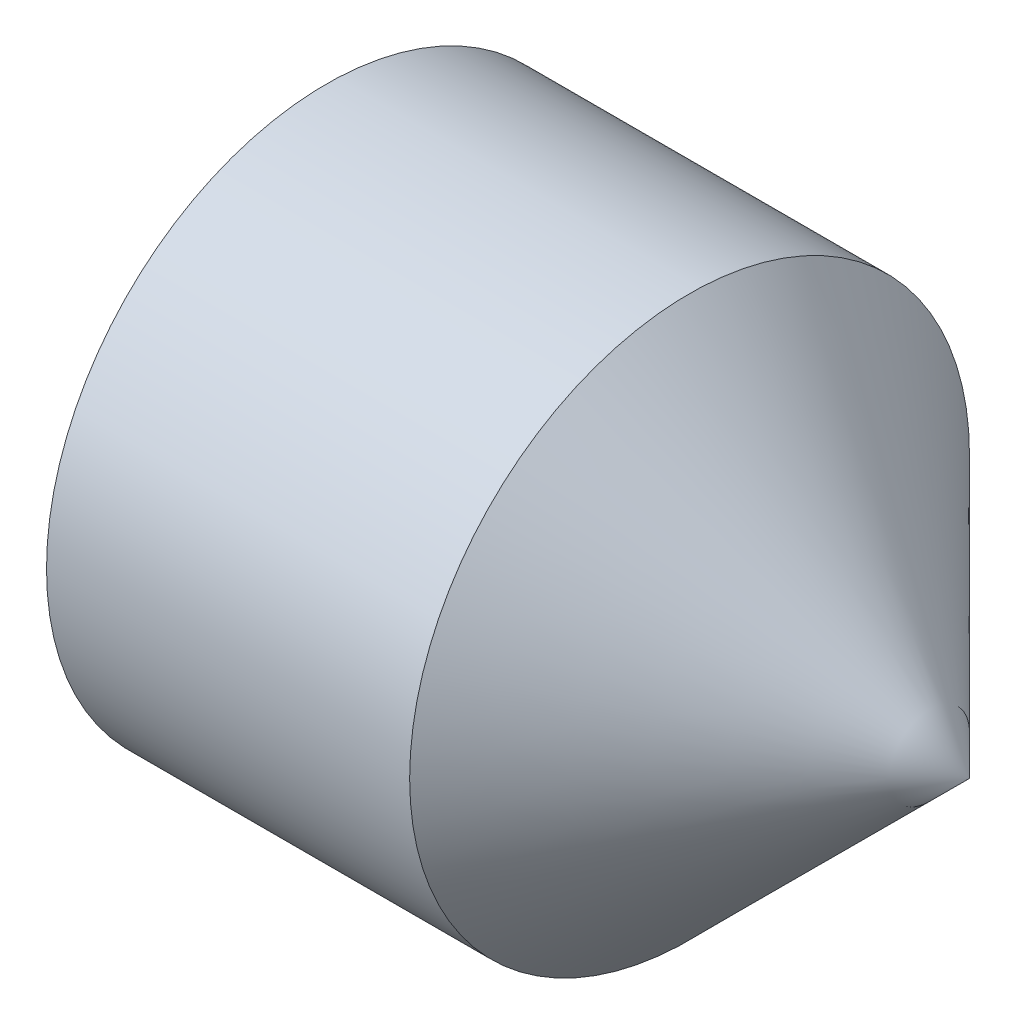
from build123d import *

# Parameters (mm, degrees)
HEX_2_DEPTH = 3


with BuildPart() as part:
    # BodySke → BaseBody (revolve)
    with BuildSketch(Plane.XY, mode=Mode.PRIVATE) as basebody_sk:
        Polygon((0, 0), (0, 2.055), (0.25692087, 2.5), (3.5, 2.5), (6, 0), align=None)
    revolve(basebody_sk.sketch.rotate(Axis((-12.7, 0, 0), (1, 0, 0)), 90), axis=Axis((-12.7, 0, 0), (1, 0, 0)))

    # Sketch2 → Hex 2 (cut)
    with BuildSketch(Plane.ZY):
        Polygon((0.721687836, 1.25), (-0.721687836, 1.25), (-1.443375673, 0), (-0.721687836, -1.25), (0.721687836, -1.25), (1.443375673, 0), align=None)
    extrude(amount=-HEX_2_DEPTH, mode=Mode.SUBTRACT)


solid = part.part
